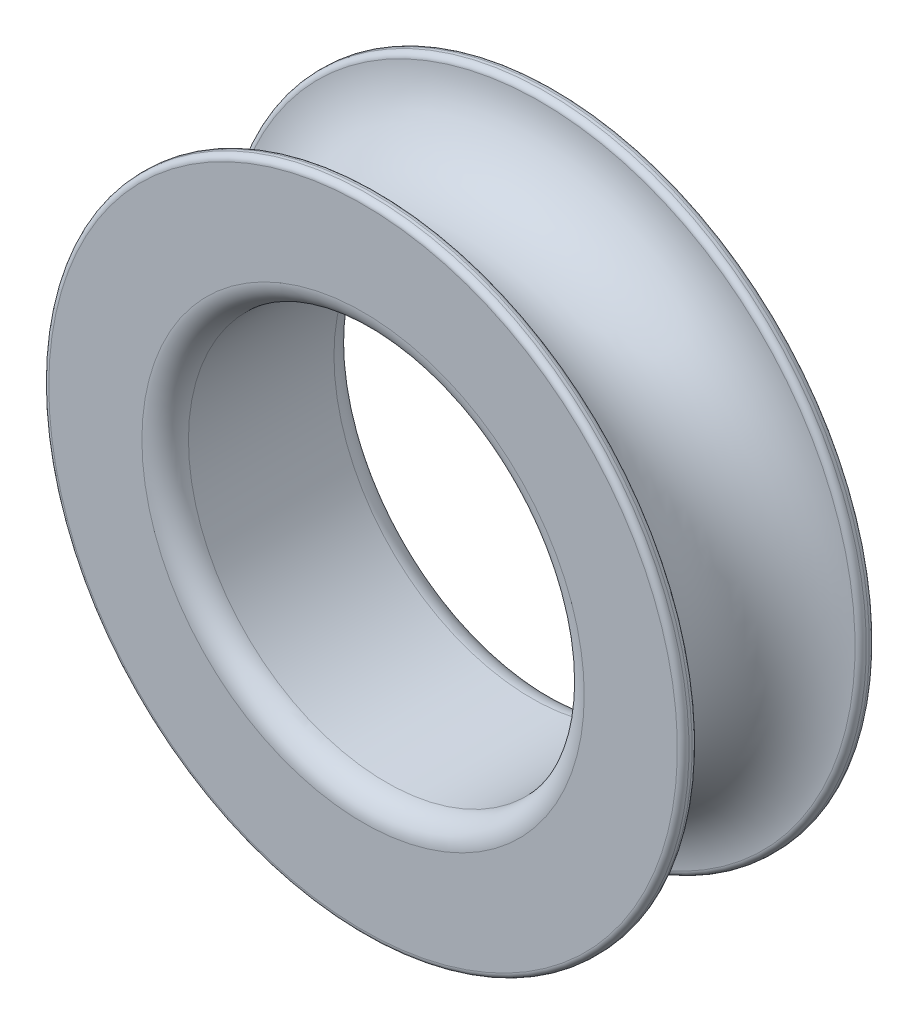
from build123d import *


with BuildPart() as part:
    # Sketch1 → Revolve1 (revolve)
    with BuildSketch(Plane.XZ, mode=Mode.PRIVATE) as revolve1_sk:
        with BuildLine():
            Line((27.5, -7.75), (27.5, -7.483314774))
            ThreePointArc((27.5, -7.483314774), (27.365148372, -7.141749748), (27.033333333, -6.984427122))
            ThreePointArc((27.033333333, -6.984427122), (20.5, 0), (27.033333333, 6.984427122))
            ThreePointArc((27.033333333, 6.984427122), (27.365148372, 7.141749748), (27.5, 7.483314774))
            Line((27.5, 7.483314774), (27.5, 7.75))
            ThreePointArc((27.5, 7.75), (27.353553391, 8.103553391), (27, 8.25))
            Line((27, 8.25), (19, 8.25))
            ThreePointArc((19, 8.25), (17.585786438, 7.664213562), (17, 6.25))
            Line((17, 6.25), (17, -6.25))
            ThreePointArc((17, -6.25), (17.585786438, -7.664213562), (19, -8.25))
            Line((19, -8.25), (27, -8.25))
            ThreePointArc((27, -8.25), (27.353553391, -8.103553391), (27.5, -7.75))
        make_face()
    revolve(revolve1_sk.sketch.rotate(Axis((0, 0, 8.84), (0, 0, -1)), 180), axis=Axis((0, 0, 8.84), (0, 0, -1)))


solid = part.part
